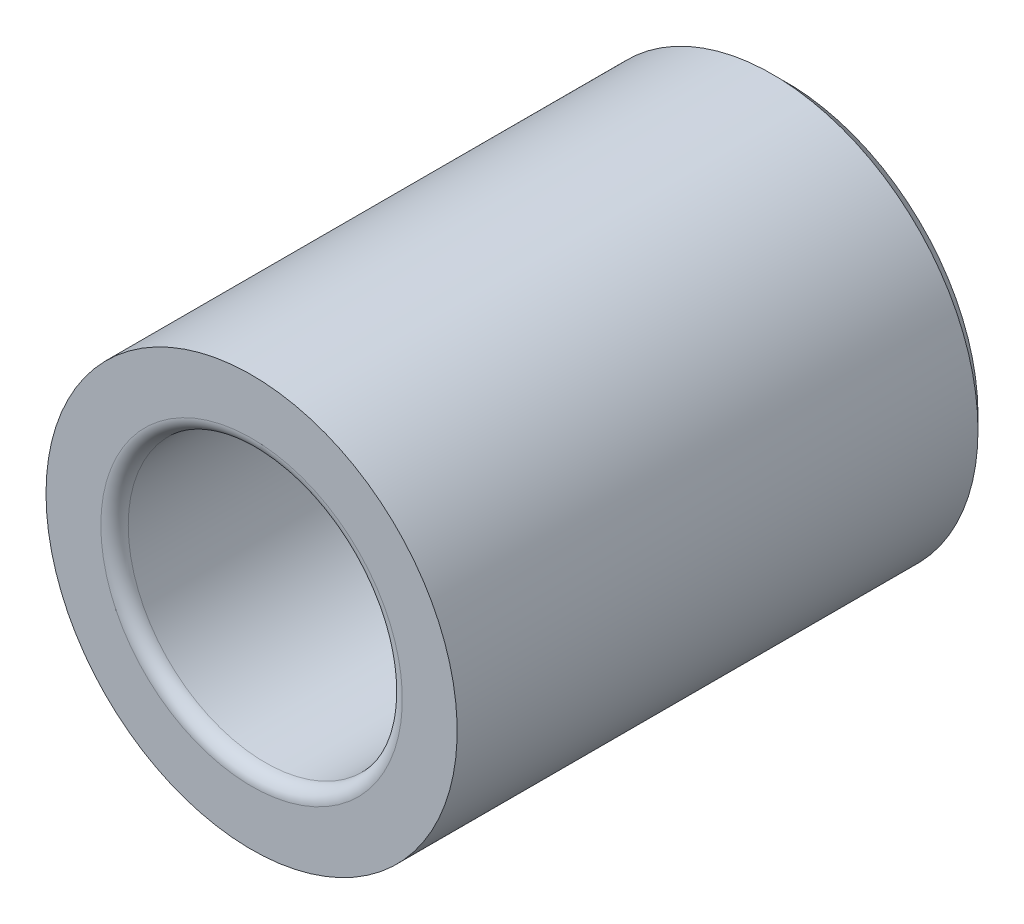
ISO-10303-21;
HEADER;
FILE_DESCRIPTION(('STEP AP214'),'2;1');
FILE_NAME('part.step','',(''),(''),'','','');
FILE_SCHEMA(('AUTOMOTIVE_DESIGN { 1 0 10303 214 1 1 1 1 }'));
ENDSEC;
DATA;
#1=APPLICATION_CONTEXT('core data for automotive mechanical design processes');
#2=APPLICATION_PROTOCOL_DEFINITION('international standard','automotive_design',2000,#1);
#3=PRODUCT_CONTEXT('',#1,'mechanical');
#4=PRODUCT('Part','Part','',(#3));
#5=PRODUCT_RELATED_PRODUCT_CATEGORY('part','',(#4));
#6=PRODUCT_DEFINITION_FORMATION('','',#4);
#7=PRODUCT_DEFINITION_CONTEXT('part definition',#1,'design');
#8=PRODUCT_DEFINITION('design','',#6,#7);
#9=PRODUCT_DEFINITION_SHAPE('','',#8);
#10=(LENGTH_UNIT() NAMED_UNIT(*) SI_UNIT(.MILLI.,.METRE.));
#11=(NAMED_UNIT(*) PLANE_ANGLE_UNIT() SI_UNIT($,.RADIAN.));
#12=(NAMED_UNIT(*) SI_UNIT($,.STERADIAN.) SOLID_ANGLE_UNIT());
#13=UNCERTAINTY_MEASURE_WITH_UNIT(LENGTH_MEASURE(1.E-05),#10,'distance_accuracy_value','');
#14=(GEOMETRIC_REPRESENTATION_CONTEXT(3) GLOBAL_UNCERTAINTY_ASSIGNED_CONTEXT((#13)) GLOBAL_UNIT_ASSIGNED_CONTEXT((#10,
#11,#12)) REPRESENTATION_CONTEXT('',''));
#15=CARTESIAN_POINT('',(0.,0.,0.));
#16=DIRECTION('',(0.,0.,1.));
#17=DIRECTION('',(1.,0.,0.));
#18=AXIS2_PLACEMENT_3D('',#15,#16,#17);
#19=CARTESIAN_POINT('',(0.,0.,-0.5));
#20=DIRECTION('',(0.,0.,-1.));
#21=DIRECTION('',(-1.,0.,0.));
#22=AXIS2_PLACEMENT_3D('',#19,#20,#21);
#23=PLANE('',#22);
#24=CARTESIAN_POINT('',(0.,0.,-0.5));
#25=DIRECTION('',(0.,0.,-1.));
#26=DIRECTION('',(-1.,0.,0.));
#27=AXIS2_PLACEMENT_3D('',#24,#25,#26);
#28=CIRCLE('',#27,11.);
#29=CARTESIAN_POINT('',(-11.,0.,-0.499999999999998));
#30=VERTEX_POINT('',#29);
#31=EDGE_CURVE('E48',#30,#30,#28,.T.);
#32=ORIENTED_EDGE('',*,*,#31,.T.);
#33=EDGE_LOOP('',(#32));
#34=FACE_BOUND('',#33,.T.);
#35=CARTESIAN_POINT('',(0.,0.,-0.5));
#36=DIRECTION('',(0.,0.,-1.));
#37=DIRECTION('',(-1.,0.,0.));
#38=AXIS2_PLACEMENT_3D('',#35,#36,#37);
#39=CIRCLE('',#38,15.);
#40=CARTESIAN_POINT('',(-15.,0.,-0.499999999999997));
#41=VERTEX_POINT('',#40);
#42=EDGE_CURVE('E61',#41,#41,#39,.T.);
#43=ORIENTED_EDGE('',*,*,#42,.F.);
#44=EDGE_LOOP('',(#43));
#45=FACE_BOUND('',#44,.T.);
#46=ADVANCED_FACE('F33',(#34,#45),#23,.F.);
#47=CARTESIAN_POINT('',(0.,0.,-0.5));
#48=DIRECTION('',(0.,0.,-1.));
#49=DIRECTION('',(-1.,0.,0.));
#50=AXIS2_PLACEMENT_3D('',#47,#48,#49);
#51=CYLINDRICAL_SURFACE('',#50,15.);
#52=CARTESIAN_POINT('',(0.,0.,-38.5));
#53=DIRECTION('',(0.,0.,1.));
#54=DIRECTION('',(1.,0.,0.));
#55=AXIS2_PLACEMENT_3D('',#52,#53,#54);
#56=CIRCLE('',#55,15.);
#57=CARTESIAN_POINT('',(15.,0.,-38.5));
#58=VERTEX_POINT('',#57);
#59=EDGE_CURVE('E10',#58,#58,#56,.T.);
#60=ORIENTED_EDGE('',*,*,#59,.T.);
#61=EDGE_LOOP('',(#60));
#62=FACE_BOUND('',#61,.T.);
#63=ORIENTED_EDGE('',*,*,#42,.T.);
#64=EDGE_LOOP('',(#63));
#65=FACE_BOUND('',#64,.T.);
#66=ADVANCED_FACE('F77',(#62,#65),#51,.T.);
#67=CARTESIAN_POINT('',(0.,0.,-39.5));
#68=DIRECTION('',(0.,0.,1.));
#69=DIRECTION('',(1.,0.,0.));
#70=AXIS2_PLACEMENT_3D('',#67,#68,#69);
#71=PLANE('',#70);
#72=CARTESIAN_POINT('',(0.,0.,-39.5));
#73=DIRECTION('',(0.,0.,1.));
#74=DIRECTION('',(1.,0.,0.));
#75=AXIS2_PLACEMENT_3D('',#72,#73,#74);
#76=CIRCLE('',#75,14.);
#77=CARTESIAN_POINT('',(14.,0.,-39.5));
#78=VERTEX_POINT('',#77);
#79=EDGE_CURVE('E40',#78,#78,#76,.F.);
#80=ORIENTED_EDGE('',*,*,#79,.T.);
#81=EDGE_LOOP('',(#80));
#82=FACE_BOUND('',#81,.T.);
#83=CARTESIAN_POINT('',(0.,0.,-39.5));
#84=DIRECTION('',(0.,0.,-1.));
#85=DIRECTION('',(-1.,0.,0.));
#86=AXIS2_PLACEMENT_3D('',#83,#84,#85);
#87=CIRCLE('',#86,4.25);
#88=CARTESIAN_POINT('',(-4.25000000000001,0.,-39.5));
#89=VERTEX_POINT('',#88);
#90=EDGE_CURVE('E68',#89,#89,#87,.T.);
#91=ORIENTED_EDGE('',*,*,#90,.F.);
#92=EDGE_LOOP('',(#91));
#93=FACE_BOUND('',#92,.T.);
#94=ADVANCED_FACE('F74',(#82,#93),#71,.F.);
#95=CARTESIAN_POINT('',(0.,0.,-26.));
#96=DIRECTION('',(0.,0.,1.));
#97=DIRECTION('',(1.,0.,0.));
#98=AXIS2_PLACEMENT_3D('',#95,#96,#97);
#99=PLANE('',#98);
#100=CARTESIAN_POINT('',(0.,0.,-26.));
#101=DIRECTION('',(0.,0.,1.));
#102=DIRECTION('',(1.,0.,0.));
#103=AXIS2_PLACEMENT_3D('',#100,#101,#102);
#104=CIRCLE('',#103,4.24999999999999);
#105=CARTESIAN_POINT('',(4.24999999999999,0.,-26.));
#106=VERTEX_POINT('',#105);
#107=EDGE_CURVE('E58',#106,#106,#104,.T.);
#108=ORIENTED_EDGE('',*,*,#107,.F.);
#109=EDGE_LOOP('',(#108));
#110=FACE_BOUND('',#109,.T.);
#111=CARTESIAN_POINT('',(0.,0.,-26.));
#112=DIRECTION('',(0.,0.,1.));
#113=DIRECTION('',(1.,0.,0.));
#114=AXIS2_PLACEMENT_3D('',#111,#112,#113);
#115=CIRCLE('',#114,9.99999999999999);
#116=CARTESIAN_POINT('',(9.99999999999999,0.,-26.));
#117=VERTEX_POINT('',#116);
#118=EDGE_CURVE('E53',#117,#117,#115,.T.);
#119=ORIENTED_EDGE('',*,*,#118,.T.);
#120=EDGE_LOOP('',(#119));
#121=FACE_BOUND('',#120,.T.);
#122=ADVANCED_FACE('F76',(#110,#121),#99,.T.);
#123=CARTESIAN_POINT('',(0.,0.,-0.5));
#124=DIRECTION('',(0.,0.,-1.));
#125=DIRECTION('',(-1.,0.,0.));
#126=AXIS2_PLACEMENT_3D('',#123,#124,#125);
#127=CYLINDRICAL_SURFACE('',#126,10.);
#128=CARTESIAN_POINT('',(0.,0.,-1.5));
#129=DIRECTION('',(0.,0.,-1.));
#130=DIRECTION('',(-1.,0.,0.));
#131=AXIS2_PLACEMENT_3D('',#128,#129,#130);
#132=CIRCLE('',#131,10.);
#133=CARTESIAN_POINT('',(-10.,0.,-1.5));
#134=VERTEX_POINT('',#133);
#135=EDGE_CURVE('E44',#134,#134,#132,.F.);
#136=ORIENTED_EDGE('',*,*,#135,.T.);
#137=EDGE_LOOP('',(#136));
#138=FACE_BOUND('',#137,.T.);
#139=CARTESIAN_POINT('',(0.,0.,-23.5));
#140=DIRECTION('',(0.,0.,-1.));
#141=DIRECTION('',(-1.,0.,0.));
#142=AXIS2_PLACEMENT_3D('',#139,#140,#141);
#143=CIRCLE('',#142,10.);
#144=CARTESIAN_POINT('',(-10.,0.,-23.5));
#145=VERTEX_POINT('',#144);
#146=EDGE_CURVE('E57',#145,#145,#143,.T.);
#147=ORIENTED_EDGE('',*,*,#146,.T.);
#148=EDGE_LOOP('',(#147));
#149=FACE_BOUND('',#148,.T.);
#150=ADVANCED_FACE('F83',(#138,#149),#127,.F.);
#151=CARTESIAN_POINT('',(0.,0.,-24.75));
#152=DIRECTION('',(0.,0.,1.));
#153=DIRECTION('',(1.,0.,0.));
#154=AXIS2_PLACEMENT_3D('',#151,#152,#153);
#155=TOROIDAL_SURFACE('',#154,9.99999999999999,1.25);
#156=ORIENTED_EDGE('',*,*,#118,.F.);
#157=EDGE_LOOP('',(#156));
#158=FACE_BOUND('',#157,.T.);
#159=CARTESIAN_POINT('',(0.,0.,-24.75));
#160=DIRECTION('',(0.,0.,1.));
#161=DIRECTION('',(1.,0.,0.));
#162=AXIS2_PLACEMENT_3D('',#159,#160,#161);
#163=CIRCLE('',#162,11.25);
#164=CARTESIAN_POINT('',(11.25,0.,-24.75));
#165=VERTEX_POINT('',#164);
#166=EDGE_CURVE('E54',#165,#165,#163,.F.);
#167=ORIENTED_EDGE('',*,*,#166,.F.);
#168=EDGE_LOOP('',(#167));
#169=FACE_BOUND('',#168,.T.);
#170=ADVANCED_FACE('F97',(#158,#169),#155,.F.);
#171=CARTESIAN_POINT('',(0.,0.,-24.75));
#172=DIRECTION('',(0.,0.,-1.));
#173=DIRECTION('',(-1.,0.,0.));
#174=AXIS2_PLACEMENT_3D('',#171,#172,#173);
#175=TOROIDAL_SURFACE('',#174,9.99999999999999,1.25);
#176=ORIENTED_EDGE('',*,*,#166,.T.);
#177=EDGE_LOOP('',(#176));
#178=FACE_BOUND('',#177,.T.);
#179=ORIENTED_EDGE('',*,*,#146,.F.);
#180=EDGE_LOOP('',(#179));
#181=FACE_BOUND('',#180,.T.);
#182=ADVANCED_FACE('F94',(#178,#181),#175,.F.);
#183=CARTESIAN_POINT('',(0.,0.,-39.5));
#184=DIRECTION('',(0.,0.,-1.));
#185=DIRECTION('',(-1.,0.,0.));
#186=AXIS2_PLACEMENT_3D('',#183,#184,#185);
#187=CYLINDRICAL_SURFACE('',#186,4.24999999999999);
#188=ORIENTED_EDGE('',*,*,#107,.T.);
#189=EDGE_LOOP('',(#188));
#190=FACE_BOUND('',#189,.T.);
#191=ORIENTED_EDGE('',*,*,#90,.T.);
#192=EDGE_LOOP('',(#191));
#193=FACE_BOUND('',#192,.T.);
#194=ADVANCED_FACE('F72',(#190,#193),#187,.F.);
#195=CARTESIAN_POINT('',(0.,0.,-1.5));
#196=DIRECTION('',(0.,0.,-1.));
#197=DIRECTION('',(-1.,0.,0.));
#198=AXIS2_PLACEMENT_3D('',#195,#196,#197);
#199=TOROIDAL_SURFACE('',#198,11.,1.);
#200=ORIENTED_EDGE('',*,*,#135,.F.);
#201=EDGE_LOOP('',(#200));
#202=FACE_BOUND('',#201,.T.);
#203=ORIENTED_EDGE('',*,*,#31,.F.);
#204=EDGE_LOOP('',(#203));
#205=FACE_BOUND('',#204,.T.);
#206=ADVANCED_FACE('F101',(#202,#205),#199,.T.);
#207=CARTESIAN_POINT('',(0.,0.,-39.5));
#208=DIRECTION('',(0.,0.,1.));
#209=DIRECTION('',(1.,0.,0.));
#210=AXIS2_PLACEMENT_3D('',#207,#208,#209);
#211=CONICAL_SURFACE('',#210,14.,0.785398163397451);
#212=ORIENTED_EDGE('',*,*,#59,.F.);
#213=EDGE_LOOP('',(#212));
#214=FACE_BOUND('',#213,.T.);
#215=ORIENTED_EDGE('',*,*,#79,.F.);
#216=EDGE_LOOP('',(#215));
#217=FACE_BOUND('',#216,.T.);
#218=ADVANCED_FACE('F35',(#214,#217),#211,.T.);
#219=CLOSED_SHELL('',(#46,#66,#94,#122,#150,#170,#182,#194,#206,#218));
#220=MANIFOLD_SOLID_BREP('B2',#219);
#221=ADVANCED_BREP_SHAPE_REPRESENTATION('',(#18,#220),#14);
#222=SHAPE_DEFINITION_REPRESENTATION(#9,#221);
ENDSEC;
END-ISO-10303-21;
